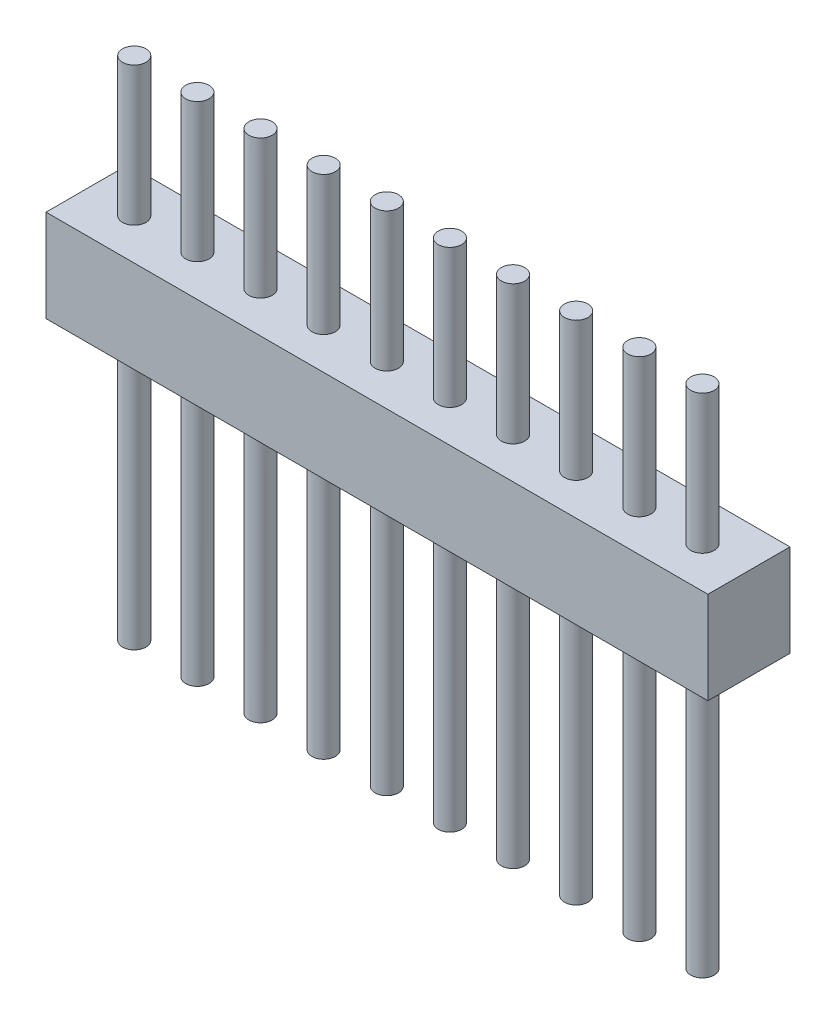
ISO-10303-21;
HEADER;
FILE_DESCRIPTION(('STEP AP214'),'2;1');
FILE_NAME('part.step','',(''),(''),'','','');
FILE_SCHEMA(('AUTOMOTIVE_DESIGN { 1 0 10303 214 1 1 1 1 }'));
ENDSEC;
DATA;
#1=APPLICATION_CONTEXT('core data for automotive mechanical design processes');
#2=APPLICATION_PROTOCOL_DEFINITION('international standard','automotive_design',2000,#1);
#3=PRODUCT_CONTEXT('',#1,'mechanical');
#4=PRODUCT('Part','Part','',(#3));
#5=PRODUCT_RELATED_PRODUCT_CATEGORY('part','',(#4));
#6=PRODUCT_DEFINITION_FORMATION('','',#4);
#7=PRODUCT_DEFINITION_CONTEXT('part definition',#1,'design');
#8=PRODUCT_DEFINITION('design','',#6,#7);
#9=PRODUCT_DEFINITION_SHAPE('','',#8);
#10=(LENGTH_UNIT() NAMED_UNIT(*) SI_UNIT(.MILLI.,.METRE.));
#11=(NAMED_UNIT(*) PLANE_ANGLE_UNIT() SI_UNIT($,.RADIAN.));
#12=(NAMED_UNIT(*) SI_UNIT($,.STERADIAN.) SOLID_ANGLE_UNIT());
#13=UNCERTAINTY_MEASURE_WITH_UNIT(LENGTH_MEASURE(1.E-05),#10,'distance_accuracy_value','');
#14=(GEOMETRIC_REPRESENTATION_CONTEXT(3) GLOBAL_UNCERTAINTY_ASSIGNED_CONTEXT((#13)) GLOBAL_UNIT_ASSIGNED_CONTEXT((#10,
#11,#12)) REPRESENTATION_CONTEXT('',''));
#15=CARTESIAN_POINT('',(0.,0.,0.));
#16=DIRECTION('',(0.,0.,1.));
#17=DIRECTION('',(1.,0.,0.));
#18=AXIS2_PLACEMENT_3D('',#15,#16,#17);
#19=CARTESIAN_POINT('',(0.,2.6,0.));
#20=DIRECTION('',(1.,0.,0.));
#21=DIRECTION('',(0.,0.,-1.));
#22=AXIS2_PLACEMENT_3D('',#19,#20,#21);
#23=PLANE('',#22);
#24=DIRECTION('',(0.,0.,1.));
#25=VECTOR('',#24,1.);
#26=CARTESIAN_POINT('',(0.,0.,0.));
#27=LINE('',#26,#25);
#28=CARTESIAN_POINT('',(0.,0.,-2.314));
#29=VERTEX_POINT('',#28);
#30=CARTESIAN_POINT('',(0.,0.,0.));
#31=VERTEX_POINT('',#30);
#32=EDGE_CURVE('E100',#29,#31,#27,.T.);
#33=ORIENTED_EDGE('',*,*,#32,.T.);
#34=DIRECTION('',(0.,-1.,0.));
#35=VECTOR('',#34,1.);
#36=CARTESIAN_POINT('',(0.,2.6,0.));
#37=LINE('',#36,#35);
#38=CARTESIAN_POINT('',(0.,2.6,0.));
#39=VERTEX_POINT('',#38);
#40=EDGE_CURVE('E91',#39,#31,#37,.T.);
#41=ORIENTED_EDGE('',*,*,#40,.F.);
#42=DIRECTION('',(0.,0.,1.));
#43=VECTOR('',#42,1.);
#44=CARTESIAN_POINT('',(0.,2.6,0.));
#45=LINE('',#44,#43);
#46=CARTESIAN_POINT('',(0.,2.6,-2.314));
#47=VERTEX_POINT('',#46);
#48=EDGE_CURVE('E85',#47,#39,#45,.T.);
#49=ORIENTED_EDGE('',*,*,#48,.F.);
#50=DIRECTION('',(0.,-1.,0.));
#51=VECTOR('',#50,1.);
#52=CARTESIAN_POINT('',(0.,2.6,-2.314));
#53=LINE('',#52,#51);
#54=EDGE_CURVE('E96',#47,#29,#53,.T.);
#55=ORIENTED_EDGE('',*,*,#54,.T.);
#56=EDGE_LOOP('',(#33,#41,#49,#55));
#57=FACE_BOUND('',#56,.T.);
#58=ADVANCED_FACE('F33',(#57),#23,.F.);
#59=CARTESIAN_POINT('',(0.,2.6,0.));
#60=DIRECTION('',(0.,0.,-1.));
#61=DIRECTION('',(-1.,0.,0.));
#62=AXIS2_PLACEMENT_3D('',#59,#60,#61);
#63=PLANE('',#62);
#64=DIRECTION('',(1.,0.,0.));
#65=VECTOR('',#64,1.);
#66=CARTESIAN_POINT('',(0.,0.,0.));
#67=LINE('',#66,#65);
#68=CARTESIAN_POINT('',(18.66,0.,0.));
#69=VERTEX_POINT('',#68);
#70=EDGE_CURVE('E90',#31,#69,#67,.T.);
#71=ORIENTED_EDGE('',*,*,#70,.T.);
#72=DIRECTION('',(0.,-1.,0.));
#73=VECTOR('',#72,1.);
#74=CARTESIAN_POINT('',(18.66,2.6,0.));
#75=LINE('',#74,#73);
#76=CARTESIAN_POINT('',(18.66,2.6,0.));
#77=VERTEX_POINT('',#76);
#78=EDGE_CURVE('E88',#77,#69,#75,.T.);
#79=ORIENTED_EDGE('',*,*,#78,.F.);
#80=DIRECTION('',(1.,0.,0.));
#81=VECTOR('',#80,1.);
#82=CARTESIAN_POINT('',(0.,2.6,0.));
#83=LINE('',#82,#81);
#84=EDGE_CURVE('E80',#39,#77,#83,.T.);
#85=ORIENTED_EDGE('',*,*,#84,.F.);
#86=ORIENTED_EDGE('',*,*,#40,.T.);
#87=EDGE_LOOP('',(#71,#79,#85,#86));
#88=FACE_BOUND('',#87,.T.);
#89=ADVANCED_FACE('F89',(#88),#63,.F.);
#90=CARTESIAN_POINT('',(18.66,2.6,0.));
#91=DIRECTION('',(-1.,0.,0.));
#92=DIRECTION('',(0.,0.,1.));
#93=AXIS2_PLACEMENT_3D('',#90,#91,#92);
#94=PLANE('',#93);
#95=DIRECTION('',(0.,0.,-1.));
#96=VECTOR('',#95,1.);
#97=CARTESIAN_POINT('',(18.66,0.,0.));
#98=LINE('',#97,#96);
#99=CARTESIAN_POINT('',(18.66,0.,-2.314));
#100=VERTEX_POINT('',#99);
#101=EDGE_CURVE('E66',#69,#100,#98,.T.);
#102=ORIENTED_EDGE('',*,*,#101,.T.);
#103=DIRECTION('',(0.,-1.,0.));
#104=VECTOR('',#103,1.);
#105=CARTESIAN_POINT('',(18.66,2.6,-2.314));
#106=LINE('',#105,#104);
#107=CARTESIAN_POINT('',(18.66,2.6,-2.314));
#108=VERTEX_POINT('',#107);
#109=EDGE_CURVE('E92',#108,#100,#106,.T.);
#110=ORIENTED_EDGE('',*,*,#109,.F.);
#111=DIRECTION('',(0.,0.,-1.));
#112=VECTOR('',#111,1.);
#113=CARTESIAN_POINT('',(18.66,2.6,0.));
#114=LINE('',#113,#112);
#115=EDGE_CURVE('E83',#77,#108,#114,.T.);
#116=ORIENTED_EDGE('',*,*,#115,.F.);
#117=ORIENTED_EDGE('',*,*,#78,.T.);
#118=EDGE_LOOP('',(#102,#110,#116,#117));
#119=FACE_BOUND('',#118,.T.);
#120=ADVANCED_FACE('F94',(#119),#94,.F.);
#121=CARTESIAN_POINT('',(0.,2.6,-2.314));
#122=DIRECTION('',(0.,0.,1.));
#123=DIRECTION('',(1.,0.,0.));
#124=AXIS2_PLACEMENT_3D('',#121,#122,#123);
#125=PLANE('',#124);
#126=DIRECTION('',(-1.,0.,0.));
#127=VECTOR('',#126,1.);
#128=CARTESIAN_POINT('',(0.,0.,-2.314));
#129=LINE('',#128,#127);
#130=EDGE_CURVE('E72',#100,#29,#129,.T.);
#131=ORIENTED_EDGE('',*,*,#130,.T.);
#132=ORIENTED_EDGE('',*,*,#54,.F.);
#133=DIRECTION('',(-1.,0.,0.));
#134=VECTOR('',#133,1.);
#135=CARTESIAN_POINT('',(0.,2.6,-2.314));
#136=LINE('',#135,#134);
#137=EDGE_CURVE('E49',#108,#47,#136,.T.);
#138=ORIENTED_EDGE('',*,*,#137,.F.);
#139=ORIENTED_EDGE('',*,*,#109,.T.);
#140=EDGE_LOOP('',(#131,#132,#138,#139));
#141=FACE_BOUND('',#140,.T.);
#142=ADVANCED_FACE('F163',(#141),#125,.F.);
#143=CARTESIAN_POINT('',(0.,2.6,0.));
#144=DIRECTION('',(0.,-1.,0.));
#145=DIRECTION('',(0.,0.,-1.));
#146=AXIS2_PLACEMENT_3D('',#143,#144,#145);
#147=PLANE('',#146);
#148=CARTESIAN_POINT('',(17.35,2.6,-1.157));
#149=DIRECTION('',(0.,-1.,0.));
#150=DIRECTION('',(0.,0.,-1.));
#151=AXIS2_PLACEMENT_3D('',#148,#149,#150);
#152=CIRCLE('',#151,0.33);
#153=CARTESIAN_POINT('',(17.35,2.6,-1.487));
#154=VERTEX_POINT('',#153);
#155=EDGE_CURVE('E596',#154,#154,#152,.T.);
#156=ORIENTED_EDGE('',*,*,#155,.T.);
#157=EDGE_LOOP('',(#156));
#158=FACE_BOUND('',#157,.T.);
#159=CARTESIAN_POINT('',(15.57,2.6,-1.157));
#160=DIRECTION('',(0.,-1.,0.));
#161=DIRECTION('',(0.,0.,-1.));
#162=AXIS2_PLACEMENT_3D('',#159,#160,#161);
#163=CIRCLE('',#162,0.33);
#164=CARTESIAN_POINT('',(15.57,2.6,-1.487));
#165=VERTEX_POINT('',#164);
#166=EDGE_CURVE('E607',#165,#165,#163,.T.);
#167=ORIENTED_EDGE('',*,*,#166,.T.);
#168=EDGE_LOOP('',(#167));
#169=FACE_BOUND('',#168,.T.);
#170=CARTESIAN_POINT('',(13.79,2.6,-1.157));
#171=DIRECTION('',(0.,-1.,0.));
#172=DIRECTION('',(0.,0.,-1.));
#173=AXIS2_PLACEMENT_3D('',#170,#171,#172);
#174=CIRCLE('',#173,0.33);
#175=CARTESIAN_POINT('',(13.79,2.6,-1.487));
#176=VERTEX_POINT('',#175);
#177=EDGE_CURVE('E616',#176,#176,#174,.T.);
#178=ORIENTED_EDGE('',*,*,#177,.T.);
#179=EDGE_LOOP('',(#178));
#180=FACE_BOUND('',#179,.T.);
#181=CARTESIAN_POINT('',(12.01,2.6,-1.157));
#182=DIRECTION('',(0.,-1.,0.));
#183=DIRECTION('',(0.,0.,-1.));
#184=AXIS2_PLACEMENT_3D('',#181,#182,#183);
#185=CIRCLE('',#184,0.33);
#186=CARTESIAN_POINT('',(12.01,2.6,-1.487));
#187=VERTEX_POINT('',#186);
#188=EDGE_CURVE('E625',#187,#187,#185,.T.);
#189=ORIENTED_EDGE('',*,*,#188,.T.);
#190=EDGE_LOOP('',(#189));
#191=FACE_BOUND('',#190,.T.);
#192=CARTESIAN_POINT('',(10.23,2.6,-1.157));
#193=DIRECTION('',(0.,-1.,0.));
#194=DIRECTION('',(0.,0.,-1.));
#195=AXIS2_PLACEMENT_3D('',#192,#193,#194);
#196=CIRCLE('',#195,0.33);
#197=CARTESIAN_POINT('',(10.23,2.6,-1.487));
#198=VERTEX_POINT('',#197);
#199=EDGE_CURVE('E634',#198,#198,#196,.T.);
#200=ORIENTED_EDGE('',*,*,#199,.T.);
#201=EDGE_LOOP('',(#200));
#202=FACE_BOUND('',#201,.T.);
#203=CARTESIAN_POINT('',(8.45,2.6,-1.157));
#204=DIRECTION('',(0.,-1.,0.));
#205=DIRECTION('',(0.,0.,-1.));
#206=AXIS2_PLACEMENT_3D('',#203,#204,#205);
#207=CIRCLE('',#206,0.33);
#208=CARTESIAN_POINT('',(8.45,2.6,-1.487));
#209=VERTEX_POINT('',#208);
#210=EDGE_CURVE('E643',#209,#209,#207,.T.);
#211=ORIENTED_EDGE('',*,*,#210,.T.);
#212=EDGE_LOOP('',(#211));
#213=FACE_BOUND('',#212,.T.);
#214=CARTESIAN_POINT('',(6.67,2.6,-1.157));
#215=DIRECTION('',(0.,-1.,0.));
#216=DIRECTION('',(0.,0.,-1.));
#217=AXIS2_PLACEMENT_3D('',#214,#215,#216);
#218=CIRCLE('',#217,0.33);
#219=CARTESIAN_POINT('',(6.67,2.6,-1.487));
#220=VERTEX_POINT('',#219);
#221=EDGE_CURVE('E652',#220,#220,#218,.T.);
#222=ORIENTED_EDGE('',*,*,#221,.T.);
#223=EDGE_LOOP('',(#222));
#224=FACE_BOUND('',#223,.T.);
#225=CARTESIAN_POINT('',(4.89,2.6,-1.157));
#226=DIRECTION('',(0.,-1.,0.));
#227=DIRECTION('',(0.,0.,-1.));
#228=AXIS2_PLACEMENT_3D('',#225,#226,#227);
#229=CIRCLE('',#228,0.33);
#230=CARTESIAN_POINT('',(4.89,2.6,-1.487));
#231=VERTEX_POINT('',#230);
#232=EDGE_CURVE('E661',#231,#231,#229,.T.);
#233=ORIENTED_EDGE('',*,*,#232,.T.);
#234=EDGE_LOOP('',(#233));
#235=FACE_BOUND('',#234,.T.);
#236=CARTESIAN_POINT('',(3.11,2.6,-1.157));
#237=DIRECTION('',(0.,-1.,0.));
#238=DIRECTION('',(0.,0.,-1.));
#239=AXIS2_PLACEMENT_3D('',#236,#237,#238);
#240=CIRCLE('',#239,0.33);
#241=CARTESIAN_POINT('',(3.11,2.6,-1.487));
#242=VERTEX_POINT('',#241);
#243=EDGE_CURVE('E670',#242,#242,#240,.T.);
#244=ORIENTED_EDGE('',*,*,#243,.T.);
#245=EDGE_LOOP('',(#244));
#246=FACE_BOUND('',#245,.T.);
#247=CARTESIAN_POINT('',(1.33,2.6,-1.157));
#248=DIRECTION('',(0.,-1.,0.));
#249=DIRECTION('',(0.,0.,-1.));
#250=AXIS2_PLACEMENT_3D('',#247,#248,#249);
#251=CIRCLE('',#250,0.33);
#252=CARTESIAN_POINT('',(1.33,2.6,-1.487));
#253=VERTEX_POINT('',#252);
#254=EDGE_CURVE('E103',#253,#253,#251,.T.);
#255=ORIENTED_EDGE('',*,*,#254,.T.);
#256=EDGE_LOOP('',(#255));
#257=FACE_BOUND('',#256,.T.);
#258=ORIENTED_EDGE('',*,*,#48,.T.);
#259=ORIENTED_EDGE('',*,*,#84,.T.);
#260=ORIENTED_EDGE('',*,*,#115,.T.);
#261=ORIENTED_EDGE('',*,*,#137,.T.);
#262=EDGE_LOOP('',(#258,#259,#260,#261));
#263=FACE_BOUND('',#262,.T.);
#264=ADVANCED_FACE('F81',(#158,#169,#180,#191,#202,#213,#224,#235,#246,#257,#263),#147,.F.);
#265=CARTESIAN_POINT('',(0.,0.,0.));
#266=DIRECTION('',(0.,-1.,0.));
#267=DIRECTION('',(0.,0.,-1.));
#268=AXIS2_PLACEMENT_3D('',#265,#266,#267);
#269=PLANE('',#268);
#270=CARTESIAN_POINT('',(17.35,0.,-1.157));
#271=DIRECTION('',(0.,-1.,0.));
#272=DIRECTION('',(0.,0.,-1.));
#273=AXIS2_PLACEMENT_3D('',#270,#271,#272);
#274=CIRCLE('',#273,0.33);
#275=CARTESIAN_POINT('',(17.35,0.,-1.487));
#276=VERTEX_POINT('',#275);
#277=EDGE_CURVE('E11',#276,#276,#274,.T.);
#278=ORIENTED_EDGE('',*,*,#277,.F.);
#279=EDGE_LOOP('',(#278));
#280=FACE_BOUND('',#279,.T.);
#281=CARTESIAN_POINT('',(15.57,0.,-1.157));
#282=DIRECTION('',(0.,-1.,0.));
#283=DIRECTION('',(0.,0.,-1.));
#284=AXIS2_PLACEMENT_3D('',#281,#282,#283);
#285=CIRCLE('',#284,0.33);
#286=CARTESIAN_POINT('',(15.57,0.,-1.487));
#287=VERTEX_POINT('',#286);
#288=EDGE_CURVE('E41',#287,#287,#285,.T.);
#289=ORIENTED_EDGE('',*,*,#288,.F.);
#290=EDGE_LOOP('',(#289));
#291=FACE_BOUND('',#290,.T.);
#292=CARTESIAN_POINT('',(13.79,0.,-1.157));
#293=DIRECTION('',(0.,-1.,0.));
#294=DIRECTION('',(0.,0.,-1.));
#295=AXIS2_PLACEMENT_3D('',#292,#293,#294);
#296=CIRCLE('',#295,0.33);
#297=CARTESIAN_POINT('',(13.79,0.,-1.487));
#298=VERTEX_POINT('',#297);
#299=EDGE_CURVE('E131',#298,#298,#296,.T.);
#300=ORIENTED_EDGE('',*,*,#299,.F.);
#301=EDGE_LOOP('',(#300));
#302=FACE_BOUND('',#301,.T.);
#303=CARTESIAN_POINT('',(12.01,0.,-1.157));
#304=DIRECTION('',(0.,-1.,0.));
#305=DIRECTION('',(0.,0.,-1.));
#306=AXIS2_PLACEMENT_3D('',#303,#304,#305);
#307=CIRCLE('',#306,0.33);
#308=CARTESIAN_POINT('',(12.01,0.,-1.487));
#309=VERTEX_POINT('',#308);
#310=EDGE_CURVE('E128',#309,#309,#307,.T.);
#311=ORIENTED_EDGE('',*,*,#310,.F.);
#312=EDGE_LOOP('',(#311));
#313=FACE_BOUND('',#312,.T.);
#314=CARTESIAN_POINT('',(10.23,0.,-1.157));
#315=DIRECTION('',(0.,-1.,0.));
#316=DIRECTION('',(0.,0.,-1.));
#317=AXIS2_PLACEMENT_3D('',#314,#315,#316);
#318=CIRCLE('',#317,0.33);
#319=CARTESIAN_POINT('',(10.23,0.,-1.487));
#320=VERTEX_POINT('',#319);
#321=EDGE_CURVE('E125',#320,#320,#318,.T.);
#322=ORIENTED_EDGE('',*,*,#321,.F.);
#323=EDGE_LOOP('',(#322));
#324=FACE_BOUND('',#323,.T.);
#325=CARTESIAN_POINT('',(8.45,0.,-1.157));
#326=DIRECTION('',(0.,-1.,0.));
#327=DIRECTION('',(0.,0.,-1.));
#328=AXIS2_PLACEMENT_3D('',#325,#326,#327);
#329=CIRCLE('',#328,0.33);
#330=CARTESIAN_POINT('',(8.45,0.,-1.487));
#331=VERTEX_POINT('',#330);
#332=EDGE_CURVE('E122',#331,#331,#329,.T.);
#333=ORIENTED_EDGE('',*,*,#332,.F.);
#334=EDGE_LOOP('',(#333));
#335=FACE_BOUND('',#334,.T.);
#336=CARTESIAN_POINT('',(6.67,0.,-1.157));
#337=DIRECTION('',(0.,-1.,0.));
#338=DIRECTION('',(0.,0.,-1.));
#339=AXIS2_PLACEMENT_3D('',#336,#337,#338);
#340=CIRCLE('',#339,0.33);
#341=CARTESIAN_POINT('',(6.67,0.,-1.487));
#342=VERTEX_POINT('',#341);
#343=EDGE_CURVE('E119',#342,#342,#340,.T.);
#344=ORIENTED_EDGE('',*,*,#343,.F.);
#345=EDGE_LOOP('',(#344));
#346=FACE_BOUND('',#345,.T.);
#347=CARTESIAN_POINT('',(4.89,0.,-1.157));
#348=DIRECTION('',(0.,-1.,0.));
#349=DIRECTION('',(0.,0.,-1.));
#350=AXIS2_PLACEMENT_3D('',#347,#348,#349);
#351=CIRCLE('',#350,0.33);
#352=CARTESIAN_POINT('',(4.89,0.,-1.487));
#353=VERTEX_POINT('',#352);
#354=EDGE_CURVE('E116',#353,#353,#351,.T.);
#355=ORIENTED_EDGE('',*,*,#354,.F.);
#356=EDGE_LOOP('',(#355));
#357=FACE_BOUND('',#356,.T.);
#358=CARTESIAN_POINT('',(3.11,0.,-1.157));
#359=DIRECTION('',(0.,-1.,0.));
#360=DIRECTION('',(0.,0.,-1.));
#361=AXIS2_PLACEMENT_3D('',#358,#359,#360);
#362=CIRCLE('',#361,0.33);
#363=CARTESIAN_POINT('',(3.11,0.,-1.487));
#364=VERTEX_POINT('',#363);
#365=EDGE_CURVE('E113',#364,#364,#362,.T.);
#366=ORIENTED_EDGE('',*,*,#365,.F.);
#367=EDGE_LOOP('',(#366));
#368=FACE_BOUND('',#367,.T.);
#369=CARTESIAN_POINT('',(1.33,0.,-1.157));
#370=DIRECTION('',(0.,-1.,0.));
#371=DIRECTION('',(0.,0.,-1.));
#372=AXIS2_PLACEMENT_3D('',#369,#370,#371);
#373=CIRCLE('',#372,0.33);
#374=CARTESIAN_POINT('',(1.33,0.,-1.487));
#375=VERTEX_POINT('',#374);
#376=EDGE_CURVE('E110',#375,#375,#373,.T.);
#377=ORIENTED_EDGE('',*,*,#376,.F.);
#378=EDGE_LOOP('',(#377));
#379=FACE_BOUND('',#378,.T.);
#380=ORIENTED_EDGE('',*,*,#32,.F.);
#381=ORIENTED_EDGE('',*,*,#130,.F.);
#382=ORIENTED_EDGE('',*,*,#101,.F.);
#383=ORIENTED_EDGE('',*,*,#70,.F.);
#384=EDGE_LOOP('',(#380,#381,#382,#383));
#385=FACE_BOUND('',#384,.T.);
#386=ADVANCED_FACE('F139',(#280,#291,#302,#313,#324,#335,#346,#357,#368,#379,#385),#269,.T.);
#387=CARTESIAN_POINT('',(1.33,-7.77,-1.157));
#388=DIRECTION('',(0.,1.,0.));
#389=DIRECTION('',(0.,0.,1.));
#390=AXIS2_PLACEMENT_3D('',#387,#388,#389);
#391=PLANE('',#390);
#392=CARTESIAN_POINT('',(1.33,-7.77,-1.157));
#393=DIRECTION('',(0.,1.,0.));
#394=DIRECTION('',(0.,0.,1.));
#395=AXIS2_PLACEMENT_3D('',#392,#393,#394);
#396=CIRCLE('',#395,0.33);
#397=CARTESIAN_POINT('',(1.33,-7.77,-0.827));
#398=VERTEX_POINT('',#397);
#399=EDGE_CURVE('E676',#398,#398,#396,.T.);
#400=ORIENTED_EDGE('',*,*,#399,.F.);
#401=EDGE_LOOP('',(#400));
#402=FACE_BOUND('',#401,.T.);
#403=ADVANCED_FACE('F142',(#402),#391,.F.);
#404=CARTESIAN_POINT('',(1.33,-7.77,-1.157));
#405=DIRECTION('',(0.,1.,0.));
#406=DIRECTION('',(0.,0.,1.));
#407=AXIS2_PLACEMENT_3D('',#404,#405,#406);
#408=CYLINDRICAL_SURFACE('',#407,0.33);
#409=ORIENTED_EDGE('',*,*,#376,.T.);
#410=EDGE_LOOP('',(#409));
#411=FACE_BOUND('',#410,.T.);
#412=ORIENTED_EDGE('',*,*,#399,.T.);
#413=EDGE_LOOP('',(#412));
#414=FACE_BOUND('',#413,.T.);
#415=ADVANCED_FACE('F208',(#411,#414),#408,.T.);
#416=CARTESIAN_POINT('',(1.33,6.51,-1.157));
#417=DIRECTION('',(0.,1.,0.));
#418=DIRECTION('',(0.,0.,1.));
#419=AXIS2_PLACEMENT_3D('',#416,#417,#418);
#420=CIRCLE('',#419,0.33);
#421=CARTESIAN_POINT('',(1.33,6.51,-0.827));
#422=VERTEX_POINT('',#421);
#423=EDGE_CURVE('E673',#422,#422,#420,.T.);
#424=ORIENTED_EDGE('',*,*,#423,.F.);
#425=EDGE_LOOP('',(#424));
#426=FACE_BOUND('',#425,.T.);
#427=ORIENTED_EDGE('',*,*,#254,.F.);
#428=EDGE_LOOP('',(#427));
#429=FACE_BOUND('',#428,.T.);
#430=ADVANCED_FACE('F218',(#426,#429),#408,.T.);
#431=CARTESIAN_POINT('',(1.33,6.51,-1.157));
#432=DIRECTION('',(0.,1.,0.));
#433=DIRECTION('',(0.,0.,1.));
#434=AXIS2_PLACEMENT_3D('',#431,#432,#433);
#435=PLANE('',#434);
#436=ORIENTED_EDGE('',*,*,#423,.T.);
#437=EDGE_LOOP('',(#436));
#438=FACE_BOUND('',#437,.T.);
#439=ADVANCED_FACE('F228',(#438),#435,.T.);
#440=CARTESIAN_POINT('',(3.11,-7.77,-1.157));
#441=DIRECTION('',(0.,1.,0.));
#442=DIRECTION('',(0.,0.,1.));
#443=AXIS2_PLACEMENT_3D('',#440,#441,#442);
#444=PLANE('',#443);
#445=CARTESIAN_POINT('',(3.11,-7.77,-1.157));
#446=DIRECTION('',(0.,1.,0.));
#447=DIRECTION('',(0.,0.,1.));
#448=AXIS2_PLACEMENT_3D('',#445,#446,#447);
#449=CIRCLE('',#448,0.33);
#450=CARTESIAN_POINT('',(3.11,-7.77,-0.827));
#451=VERTEX_POINT('',#450);
#452=EDGE_CURVE('E667',#451,#451,#449,.T.);
#453=ORIENTED_EDGE('',*,*,#452,.F.);
#454=EDGE_LOOP('',(#453));
#455=FACE_BOUND('',#454,.T.);
#456=ADVANCED_FACE('F237',(#455),#444,.F.);
#457=CARTESIAN_POINT('',(3.11,-7.77,-1.157));
#458=DIRECTION('',(0.,1.,0.));
#459=DIRECTION('',(0.,0.,1.));
#460=AXIS2_PLACEMENT_3D('',#457,#458,#459);
#461=CYLINDRICAL_SURFACE('',#460,0.33);
#462=ORIENTED_EDGE('',*,*,#365,.T.);
#463=EDGE_LOOP('',(#462));
#464=FACE_BOUND('',#463,.T.);
#465=ORIENTED_EDGE('',*,*,#452,.T.);
#466=EDGE_LOOP('',(#465));
#467=FACE_BOUND('',#466,.T.);
#468=ADVANCED_FACE('F247',(#464,#467),#461,.T.);
#469=CARTESIAN_POINT('',(3.11,6.51,-1.157));
#470=DIRECTION('',(0.,1.,0.));
#471=DIRECTION('',(0.,0.,1.));
#472=AXIS2_PLACEMENT_3D('',#469,#470,#471);
#473=CIRCLE('',#472,0.33);
#474=CARTESIAN_POINT('',(3.11,6.51,-0.827));
#475=VERTEX_POINT('',#474);
#476=EDGE_CURVE('E664',#475,#475,#473,.T.);
#477=ORIENTED_EDGE('',*,*,#476,.F.);
#478=EDGE_LOOP('',(#477));
#479=FACE_BOUND('',#478,.T.);
#480=ORIENTED_EDGE('',*,*,#243,.F.);
#481=EDGE_LOOP('',(#480));
#482=FACE_BOUND('',#481,.T.);
#483=ADVANCED_FACE('F257',(#479,#482),#461,.T.);
#484=CARTESIAN_POINT('',(3.11,6.51,-1.157));
#485=DIRECTION('',(0.,1.,0.));
#486=DIRECTION('',(0.,0.,1.));
#487=AXIS2_PLACEMENT_3D('',#484,#485,#486);
#488=PLANE('',#487);
#489=ORIENTED_EDGE('',*,*,#476,.T.);
#490=EDGE_LOOP('',(#489));
#491=FACE_BOUND('',#490,.T.);
#492=ADVANCED_FACE('F267',(#491),#488,.T.);
#493=CARTESIAN_POINT('',(4.89,-7.77,-1.157));
#494=DIRECTION('',(0.,1.,0.));
#495=DIRECTION('',(0.,0.,1.));
#496=AXIS2_PLACEMENT_3D('',#493,#494,#495);
#497=PLANE('',#496);
#498=CARTESIAN_POINT('',(4.89,-7.77,-1.157));
#499=DIRECTION('',(0.,1.,0.));
#500=DIRECTION('',(0.,0.,1.));
#501=AXIS2_PLACEMENT_3D('',#498,#499,#500);
#502=CIRCLE('',#501,0.33);
#503=CARTESIAN_POINT('',(4.89,-7.77,-0.827));
#504=VERTEX_POINT('',#503);
#505=EDGE_CURVE('E658',#504,#504,#502,.T.);
#506=ORIENTED_EDGE('',*,*,#505,.F.);
#507=EDGE_LOOP('',(#506));
#508=FACE_BOUND('',#507,.T.);
#509=ADVANCED_FACE('F276',(#508),#497,.F.);
#510=CARTESIAN_POINT('',(4.89,-7.77,-1.157));
#511=DIRECTION('',(0.,1.,0.));
#512=DIRECTION('',(0.,0.,1.));
#513=AXIS2_PLACEMENT_3D('',#510,#511,#512);
#514=CYLINDRICAL_SURFACE('',#513,0.33);
#515=ORIENTED_EDGE('',*,*,#354,.T.);
#516=EDGE_LOOP('',(#515));
#517=FACE_BOUND('',#516,.T.);
#518=ORIENTED_EDGE('',*,*,#505,.T.);
#519=EDGE_LOOP('',(#518));
#520=FACE_BOUND('',#519,.T.);
#521=ADVANCED_FACE('F286',(#517,#520),#514,.T.);
#522=CARTESIAN_POINT('',(4.89,6.51,-1.157));
#523=DIRECTION('',(0.,1.,0.));
#524=DIRECTION('',(0.,0.,1.));
#525=AXIS2_PLACEMENT_3D('',#522,#523,#524);
#526=CIRCLE('',#525,0.33);
#527=CARTESIAN_POINT('',(4.89,6.51,-0.827));
#528=VERTEX_POINT('',#527);
#529=EDGE_CURVE('E655',#528,#528,#526,.T.);
#530=ORIENTED_EDGE('',*,*,#529,.F.);
#531=EDGE_LOOP('',(#530));
#532=FACE_BOUND('',#531,.T.);
#533=ORIENTED_EDGE('',*,*,#232,.F.);
#534=EDGE_LOOP('',(#533));
#535=FACE_BOUND('',#534,.T.);
#536=ADVANCED_FACE('F296',(#532,#535),#514,.T.);
#537=CARTESIAN_POINT('',(4.89,6.51,-1.157));
#538=DIRECTION('',(0.,1.,0.));
#539=DIRECTION('',(0.,0.,1.));
#540=AXIS2_PLACEMENT_3D('',#537,#538,#539);
#541=PLANE('',#540);
#542=ORIENTED_EDGE('',*,*,#529,.T.);
#543=EDGE_LOOP('',(#542));
#544=FACE_BOUND('',#543,.T.);
#545=ADVANCED_FACE('F306',(#544),#541,.T.);
#546=CARTESIAN_POINT('',(6.67,-7.77,-1.157));
#547=DIRECTION('',(0.,1.,0.));
#548=DIRECTION('',(0.,0.,1.));
#549=AXIS2_PLACEMENT_3D('',#546,#547,#548);
#550=PLANE('',#549);
#551=CARTESIAN_POINT('',(6.67,-7.77,-1.157));
#552=DIRECTION('',(0.,1.,0.));
#553=DIRECTION('',(0.,0.,1.));
#554=AXIS2_PLACEMENT_3D('',#551,#552,#553);
#555=CIRCLE('',#554,0.33);
#556=CARTESIAN_POINT('',(6.67,-7.77,-0.827000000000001));
#557=VERTEX_POINT('',#556);
#558=EDGE_CURVE('E649',#557,#557,#555,.T.);
#559=ORIENTED_EDGE('',*,*,#558,.F.);
#560=EDGE_LOOP('',(#559));
#561=FACE_BOUND('',#560,.T.);
#562=ADVANCED_FACE('F315',(#561),#550,.F.);
#563=CARTESIAN_POINT('',(6.67,-7.77,-1.157));
#564=DIRECTION('',(0.,1.,0.));
#565=DIRECTION('',(0.,0.,1.));
#566=AXIS2_PLACEMENT_3D('',#563,#564,#565);
#567=CYLINDRICAL_SURFACE('',#566,0.33);
#568=ORIENTED_EDGE('',*,*,#343,.T.);
#569=EDGE_LOOP('',(#568));
#570=FACE_BOUND('',#569,.T.);
#571=ORIENTED_EDGE('',*,*,#558,.T.);
#572=EDGE_LOOP('',(#571));
#573=FACE_BOUND('',#572,.T.);
#574=ADVANCED_FACE('F325',(#570,#573),#567,.T.);
#575=CARTESIAN_POINT('',(6.67,6.51,-1.157));
#576=DIRECTION('',(0.,1.,0.));
#577=DIRECTION('',(0.,0.,1.));
#578=AXIS2_PLACEMENT_3D('',#575,#576,#577);
#579=CIRCLE('',#578,0.33);
#580=CARTESIAN_POINT('',(6.67,6.51,-0.827000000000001));
#581=VERTEX_POINT('',#580);
#582=EDGE_CURVE('E646',#581,#581,#579,.T.);
#583=ORIENTED_EDGE('',*,*,#582,.F.);
#584=EDGE_LOOP('',(#583));
#585=FACE_BOUND('',#584,.T.);
#586=ORIENTED_EDGE('',*,*,#221,.F.);
#587=EDGE_LOOP('',(#586));
#588=FACE_BOUND('',#587,.T.);
#589=ADVANCED_FACE('F335',(#585,#588),#567,.T.);
#590=CARTESIAN_POINT('',(6.67,6.51,-1.157));
#591=DIRECTION('',(0.,1.,0.));
#592=DIRECTION('',(0.,0.,1.));
#593=AXIS2_PLACEMENT_3D('',#590,#591,#592);
#594=PLANE('',#593);
#595=ORIENTED_EDGE('',*,*,#582,.T.);
#596=EDGE_LOOP('',(#595));
#597=FACE_BOUND('',#596,.T.);
#598=ADVANCED_FACE('F345',(#597),#594,.T.);
#599=CARTESIAN_POINT('',(8.45,-7.77,-1.157));
#600=DIRECTION('',(0.,1.,0.));
#601=DIRECTION('',(0.,0.,1.));
#602=AXIS2_PLACEMENT_3D('',#599,#600,#601);
#603=PLANE('',#602);
#604=CARTESIAN_POINT('',(8.45,-7.77,-1.157));
#605=DIRECTION('',(0.,1.,0.));
#606=DIRECTION('',(0.,0.,1.));
#607=AXIS2_PLACEMENT_3D('',#604,#605,#606);
#608=CIRCLE('',#607,0.33);
#609=CARTESIAN_POINT('',(8.45,-7.77,-0.827));
#610=VERTEX_POINT('',#609);
#611=EDGE_CURVE('E640',#610,#610,#608,.T.);
#612=ORIENTED_EDGE('',*,*,#611,.F.);
#613=EDGE_LOOP('',(#612));
#614=FACE_BOUND('',#613,.T.);
#615=ADVANCED_FACE('F354',(#614),#603,.F.);
#616=CARTESIAN_POINT('',(8.45,-7.77,-1.157));
#617=DIRECTION('',(0.,1.,0.));
#618=DIRECTION('',(0.,0.,1.));
#619=AXIS2_PLACEMENT_3D('',#616,#617,#618);
#620=CYLINDRICAL_SURFACE('',#619,0.33);
#621=ORIENTED_EDGE('',*,*,#332,.T.);
#622=EDGE_LOOP('',(#621));
#623=FACE_BOUND('',#622,.T.);
#624=ORIENTED_EDGE('',*,*,#611,.T.);
#625=EDGE_LOOP('',(#624));
#626=FACE_BOUND('',#625,.T.);
#627=ADVANCED_FACE('F364',(#623,#626),#620,.T.);
#628=CARTESIAN_POINT('',(8.45,6.51,-1.157));
#629=DIRECTION('',(0.,1.,0.));
#630=DIRECTION('',(0.,0.,1.));
#631=AXIS2_PLACEMENT_3D('',#628,#629,#630);
#632=CIRCLE('',#631,0.33);
#633=CARTESIAN_POINT('',(8.45,6.51,-0.827));
#634=VERTEX_POINT('',#633);
#635=EDGE_CURVE('E637',#634,#634,#632,.T.);
#636=ORIENTED_EDGE('',*,*,#635,.F.);
#637=EDGE_LOOP('',(#636));
#638=FACE_BOUND('',#637,.T.);
#639=ORIENTED_EDGE('',*,*,#210,.F.);
#640=EDGE_LOOP('',(#639));
#641=FACE_BOUND('',#640,.T.);
#642=ADVANCED_FACE('F374',(#638,#641),#620,.T.);
#643=CARTESIAN_POINT('',(8.45,6.51,-1.157));
#644=DIRECTION('',(0.,1.,0.));
#645=DIRECTION('',(0.,0.,1.));
#646=AXIS2_PLACEMENT_3D('',#643,#644,#645);
#647=PLANE('',#646);
#648=ORIENTED_EDGE('',*,*,#635,.T.);
#649=EDGE_LOOP('',(#648));
#650=FACE_BOUND('',#649,.T.);
#651=ADVANCED_FACE('F384',(#650),#647,.T.);
#652=CARTESIAN_POINT('',(10.23,-7.77,-1.157));
#653=DIRECTION('',(0.,1.,0.));
#654=DIRECTION('',(0.,0.,1.));
#655=AXIS2_PLACEMENT_3D('',#652,#653,#654);
#656=PLANE('',#655);
#657=CARTESIAN_POINT('',(10.23,-7.77,-1.157));
#658=DIRECTION('',(0.,1.,0.));
#659=DIRECTION('',(0.,0.,1.));
#660=AXIS2_PLACEMENT_3D('',#657,#658,#659);
#661=CIRCLE('',#660,0.33);
#662=CARTESIAN_POINT('',(10.23,-7.77,-0.827));
#663=VERTEX_POINT('',#662);
#664=EDGE_CURVE('E631',#663,#663,#661,.T.);
#665=ORIENTED_EDGE('',*,*,#664,.F.);
#666=EDGE_LOOP('',(#665));
#667=FACE_BOUND('',#666,.T.);
#668=ADVANCED_FACE('F393',(#667),#656,.F.);
#669=CARTESIAN_POINT('',(10.23,-7.77,-1.157));
#670=DIRECTION('',(0.,1.,0.));
#671=DIRECTION('',(0.,0.,1.));
#672=AXIS2_PLACEMENT_3D('',#669,#670,#671);
#673=CYLINDRICAL_SURFACE('',#672,0.33);
#674=ORIENTED_EDGE('',*,*,#321,.T.);
#675=EDGE_LOOP('',(#674));
#676=FACE_BOUND('',#675,.T.);
#677=ORIENTED_EDGE('',*,*,#664,.T.);
#678=EDGE_LOOP('',(#677));
#679=FACE_BOUND('',#678,.T.);
#680=ADVANCED_FACE('F403',(#676,#679),#673,.T.);
#681=CARTESIAN_POINT('',(10.23,6.51,-1.157));
#682=DIRECTION('',(0.,1.,0.));
#683=DIRECTION('',(0.,0.,1.));
#684=AXIS2_PLACEMENT_3D('',#681,#682,#683);
#685=CIRCLE('',#684,0.33);
#686=CARTESIAN_POINT('',(10.23,6.51,-0.827));
#687=VERTEX_POINT('',#686);
#688=EDGE_CURVE('E628',#687,#687,#685,.T.);
#689=ORIENTED_EDGE('',*,*,#688,.F.);
#690=EDGE_LOOP('',(#689));
#691=FACE_BOUND('',#690,.T.);
#692=ORIENTED_EDGE('',*,*,#199,.F.);
#693=EDGE_LOOP('',(#692));
#694=FACE_BOUND('',#693,.T.);
#695=ADVANCED_FACE('F413',(#691,#694),#673,.T.);
#696=CARTESIAN_POINT('',(10.23,6.51,-1.157));
#697=DIRECTION('',(0.,1.,0.));
#698=DIRECTION('',(0.,0.,1.));
#699=AXIS2_PLACEMENT_3D('',#696,#697,#698);
#700=PLANE('',#699);
#701=ORIENTED_EDGE('',*,*,#688,.T.);
#702=EDGE_LOOP('',(#701));
#703=FACE_BOUND('',#702,.T.);
#704=ADVANCED_FACE('F423',(#703),#700,.T.);
#705=CARTESIAN_POINT('',(12.01,-7.77,-1.157));
#706=DIRECTION('',(0.,1.,0.));
#707=DIRECTION('',(0.,0.,1.));
#708=AXIS2_PLACEMENT_3D('',#705,#706,#707);
#709=PLANE('',#708);
#710=CARTESIAN_POINT('',(12.01,-7.77,-1.157));
#711=DIRECTION('',(0.,1.,0.));
#712=DIRECTION('',(0.,0.,1.));
#713=AXIS2_PLACEMENT_3D('',#710,#711,#712);
#714=CIRCLE('',#713,0.33);
#715=CARTESIAN_POINT('',(12.01,-7.77,-0.827));
#716=VERTEX_POINT('',#715);
#717=EDGE_CURVE('E622',#716,#716,#714,.T.);
#718=ORIENTED_EDGE('',*,*,#717,.F.);
#719=EDGE_LOOP('',(#718));
#720=FACE_BOUND('',#719,.T.);
#721=ADVANCED_FACE('F432',(#720),#709,.F.);
#722=CARTESIAN_POINT('',(12.01,-7.77,-1.157));
#723=DIRECTION('',(0.,1.,0.));
#724=DIRECTION('',(0.,0.,1.));
#725=AXIS2_PLACEMENT_3D('',#722,#723,#724);
#726=CYLINDRICAL_SURFACE('',#725,0.33);
#727=ORIENTED_EDGE('',*,*,#310,.T.);
#728=EDGE_LOOP('',(#727));
#729=FACE_BOUND('',#728,.T.);
#730=ORIENTED_EDGE('',*,*,#717,.T.);
#731=EDGE_LOOP('',(#730));
#732=FACE_BOUND('',#731,.T.);
#733=ADVANCED_FACE('F442',(#729,#732),#726,.T.);
#734=CARTESIAN_POINT('',(12.01,6.51,-1.157));
#735=DIRECTION('',(0.,1.,0.));
#736=DIRECTION('',(0.,0.,1.));
#737=AXIS2_PLACEMENT_3D('',#734,#735,#736);
#738=CIRCLE('',#737,0.33);
#739=CARTESIAN_POINT('',(12.01,6.51,-0.827));
#740=VERTEX_POINT('',#739);
#741=EDGE_CURVE('E619',#740,#740,#738,.T.);
#742=ORIENTED_EDGE('',*,*,#741,.F.);
#743=EDGE_LOOP('',(#742));
#744=FACE_BOUND('',#743,.T.);
#745=ORIENTED_EDGE('',*,*,#188,.F.);
#746=EDGE_LOOP('',(#745));
#747=FACE_BOUND('',#746,.T.);
#748=ADVANCED_FACE('F452',(#744,#747),#726,.T.);
#749=CARTESIAN_POINT('',(12.01,6.51,-1.157));
#750=DIRECTION('',(0.,1.,0.));
#751=DIRECTION('',(0.,0.,1.));
#752=AXIS2_PLACEMENT_3D('',#749,#750,#751);
#753=PLANE('',#752);
#754=ORIENTED_EDGE('',*,*,#741,.T.);
#755=EDGE_LOOP('',(#754));
#756=FACE_BOUND('',#755,.T.);
#757=ADVANCED_FACE('F462',(#756),#753,.T.);
#758=CARTESIAN_POINT('',(13.79,-7.77,-1.157));
#759=DIRECTION('',(0.,1.,0.));
#760=DIRECTION('',(0.,0.,1.));
#761=AXIS2_PLACEMENT_3D('',#758,#759,#760);
#762=PLANE('',#761);
#763=CARTESIAN_POINT('',(13.79,-7.77,-1.157));
#764=DIRECTION('',(0.,1.,0.));
#765=DIRECTION('',(0.,0.,1.));
#766=AXIS2_PLACEMENT_3D('',#763,#764,#765);
#767=CIRCLE('',#766,0.33);
#768=CARTESIAN_POINT('',(13.79,-7.77,-0.827));
#769=VERTEX_POINT('',#768);
#770=EDGE_CURVE('E613',#769,#769,#767,.T.);
#771=ORIENTED_EDGE('',*,*,#770,.F.);
#772=EDGE_LOOP('',(#771));
#773=FACE_BOUND('',#772,.T.);
#774=ADVANCED_FACE('F471',(#773),#762,.F.);
#775=CARTESIAN_POINT('',(13.79,-7.77,-1.157));
#776=DIRECTION('',(0.,1.,0.));
#777=DIRECTION('',(0.,0.,1.));
#778=AXIS2_PLACEMENT_3D('',#775,#776,#777);
#779=CYLINDRICAL_SURFACE('',#778,0.33);
#780=ORIENTED_EDGE('',*,*,#299,.T.);
#781=EDGE_LOOP('',(#780));
#782=FACE_BOUND('',#781,.T.);
#783=ORIENTED_EDGE('',*,*,#770,.T.);
#784=EDGE_LOOP('',(#783));
#785=FACE_BOUND('',#784,.T.);
#786=ADVANCED_FACE('F481',(#782,#785),#779,.T.);
#787=CARTESIAN_POINT('',(13.79,6.51,-1.157));
#788=DIRECTION('',(0.,1.,0.));
#789=DIRECTION('',(0.,0.,1.));
#790=AXIS2_PLACEMENT_3D('',#787,#788,#789);
#791=CIRCLE('',#790,0.33);
#792=CARTESIAN_POINT('',(13.79,6.51,-0.827));
#793=VERTEX_POINT('',#792);
#794=EDGE_CURVE('E610',#793,#793,#791,.T.);
#795=ORIENTED_EDGE('',*,*,#794,.F.);
#796=EDGE_LOOP('',(#795));
#797=FACE_BOUND('',#796,.T.);
#798=ORIENTED_EDGE('',*,*,#177,.F.);
#799=EDGE_LOOP('',(#798));
#800=FACE_BOUND('',#799,.T.);
#801=ADVANCED_FACE('F491',(#797,#800),#779,.T.);
#802=CARTESIAN_POINT('',(13.79,6.51,-1.157));
#803=DIRECTION('',(0.,1.,0.));
#804=DIRECTION('',(0.,0.,1.));
#805=AXIS2_PLACEMENT_3D('',#802,#803,#804);
#806=PLANE('',#805);
#807=ORIENTED_EDGE('',*,*,#794,.T.);
#808=EDGE_LOOP('',(#807));
#809=FACE_BOUND('',#808,.T.);
#810=ADVANCED_FACE('F501',(#809),#806,.T.);
#811=CARTESIAN_POINT('',(15.57,-7.77,-1.157));
#812=DIRECTION('',(0.,1.,0.));
#813=DIRECTION('',(0.,0.,1.));
#814=AXIS2_PLACEMENT_3D('',#811,#812,#813);
#815=PLANE('',#814);
#816=CARTESIAN_POINT('',(15.57,-7.77,-1.157));
#817=DIRECTION('',(0.,1.,0.));
#818=DIRECTION('',(0.,0.,1.));
#819=AXIS2_PLACEMENT_3D('',#816,#817,#818);
#820=CIRCLE('',#819,0.33);
#821=CARTESIAN_POINT('',(15.57,-7.77,-0.827));
#822=VERTEX_POINT('',#821);
#823=EDGE_CURVE('E604',#822,#822,#820,.T.);
#824=ORIENTED_EDGE('',*,*,#823,.F.);
#825=EDGE_LOOP('',(#824));
#826=FACE_BOUND('',#825,.T.);
#827=ADVANCED_FACE('F510',(#826),#815,.F.);
#828=CARTESIAN_POINT('',(15.57,-7.77,-1.157));
#829=DIRECTION('',(0.,1.,0.));
#830=DIRECTION('',(0.,0.,1.));
#831=AXIS2_PLACEMENT_3D('',#828,#829,#830);
#832=CYLINDRICAL_SURFACE('',#831,0.33);
#833=ORIENTED_EDGE('',*,*,#288,.T.);
#834=EDGE_LOOP('',(#833));
#835=FACE_BOUND('',#834,.T.);
#836=ORIENTED_EDGE('',*,*,#823,.T.);
#837=EDGE_LOOP('',(#836));
#838=FACE_BOUND('',#837,.T.);
#839=ADVANCED_FACE('F136',(#835,#838),#832,.T.);
#840=CARTESIAN_POINT('',(15.57,6.51,-1.157));
#841=DIRECTION('',(0.,1.,0.));
#842=DIRECTION('',(0.,0.,1.));
#843=AXIS2_PLACEMENT_3D('',#840,#841,#842);
#844=CIRCLE('',#843,0.33);
#845=CARTESIAN_POINT('',(15.57,6.51,-0.827));
#846=VERTEX_POINT('',#845);
#847=EDGE_CURVE('E601',#846,#846,#844,.T.);
#848=ORIENTED_EDGE('',*,*,#847,.F.);
#849=EDGE_LOOP('',(#848));
#850=FACE_BOUND('',#849,.T.);
#851=ORIENTED_EDGE('',*,*,#166,.F.);
#852=EDGE_LOOP('',(#851));
#853=FACE_BOUND('',#852,.T.);
#854=ADVANCED_FACE('F529',(#850,#853),#832,.T.);
#855=CARTESIAN_POINT('',(15.57,6.51,-1.157));
#856=DIRECTION('',(0.,1.,0.));
#857=DIRECTION('',(0.,0.,1.));
#858=AXIS2_PLACEMENT_3D('',#855,#856,#857);
#859=PLANE('',#858);
#860=ORIENTED_EDGE('',*,*,#847,.T.);
#861=EDGE_LOOP('',(#860));
#862=FACE_BOUND('',#861,.T.);
#863=ADVANCED_FACE('F538',(#862),#859,.T.);
#864=CARTESIAN_POINT('',(17.35,-7.77,-1.157));
#865=DIRECTION('',(0.,1.,0.));
#866=DIRECTION('',(0.,0.,1.));
#867=AXIS2_PLACEMENT_3D('',#864,#865,#866);
#868=PLANE('',#867);
#869=CARTESIAN_POINT('',(17.35,-7.77,-1.157));
#870=DIRECTION('',(0.,1.,0.));
#871=DIRECTION('',(0.,0.,1.));
#872=AXIS2_PLACEMENT_3D('',#869,#870,#871);
#873=CIRCLE('',#872,0.33);
#874=CARTESIAN_POINT('',(17.35,-7.77,-0.827));
#875=VERTEX_POINT('',#874);
#876=EDGE_CURVE('E593',#875,#875,#873,.T.);
#877=ORIENTED_EDGE('',*,*,#876,.F.);
#878=EDGE_LOOP('',(#877));
#879=FACE_BOUND('',#878,.T.);
#880=ADVANCED_FACE('F547',(#879),#868,.F.);
#881=CARTESIAN_POINT('',(17.35,-7.77,-1.157));
#882=DIRECTION('',(0.,1.,0.));
#883=DIRECTION('',(0.,0.,1.));
#884=AXIS2_PLACEMENT_3D('',#881,#882,#883);
#885=CYLINDRICAL_SURFACE('',#884,0.33);
#886=ORIENTED_EDGE('',*,*,#277,.T.);
#887=EDGE_LOOP('',(#886));
#888=FACE_BOUND('',#887,.T.);
#889=ORIENTED_EDGE('',*,*,#876,.T.);
#890=EDGE_LOOP('',(#889));
#891=FACE_BOUND('',#890,.T.);
#892=ADVANCED_FACE('F557',(#888,#891),#885,.T.);
#893=CARTESIAN_POINT('',(17.35,6.51,-1.157));
#894=DIRECTION('',(0.,1.,0.));
#895=DIRECTION('',(0.,0.,1.));
#896=AXIS2_PLACEMENT_3D('',#893,#894,#895);
#897=CIRCLE('',#896,0.33);
#898=CARTESIAN_POINT('',(17.35,6.51,-0.827));
#899=VERTEX_POINT('',#898);
#900=EDGE_CURVE('E592',#899,#899,#897,.T.);
#901=ORIENTED_EDGE('',*,*,#900,.F.);
#902=EDGE_LOOP('',(#901));
#903=FACE_BOUND('',#902,.T.);
#904=ORIENTED_EDGE('',*,*,#155,.F.);
#905=EDGE_LOOP('',(#904));
#906=FACE_BOUND('',#905,.T.);
#907=ADVANCED_FACE('F567',(#903,#906),#885,.T.);
#908=CARTESIAN_POINT('',(17.35,6.51,-1.157));
#909=DIRECTION('',(0.,1.,0.));
#910=DIRECTION('',(0.,0.,1.));
#911=AXIS2_PLACEMENT_3D('',#908,#909,#910);
#912=PLANE('',#911);
#913=ORIENTED_EDGE('',*,*,#900,.T.);
#914=EDGE_LOOP('',(#913));
#915=FACE_BOUND('',#914,.T.);
#916=ADVANCED_FACE('F577',(#915),#912,.T.);
#917=CLOSED_SHELL('',(#58,#89,#120,#142,#264,#386,#403,#415,#430,#439,#456,#468,#483,#492,#509,
#521,#536,#545,#562,#574,#589,#598,#615,#627,#642,#651,#668,#680,#695,#704,#721,#733,#748,#757,
#774,#786,#801,#810,#827,#839,#854,#863,#880,#892,#907,#916));
#918=MANIFOLD_SOLID_BREP('B2',#917);
#919=ADVANCED_BREP_SHAPE_REPRESENTATION('',(#18,#918),#14);
#920=SHAPE_DEFINITION_REPRESENTATION(#9,#919);
ENDSEC;
END-ISO-10303-21;
